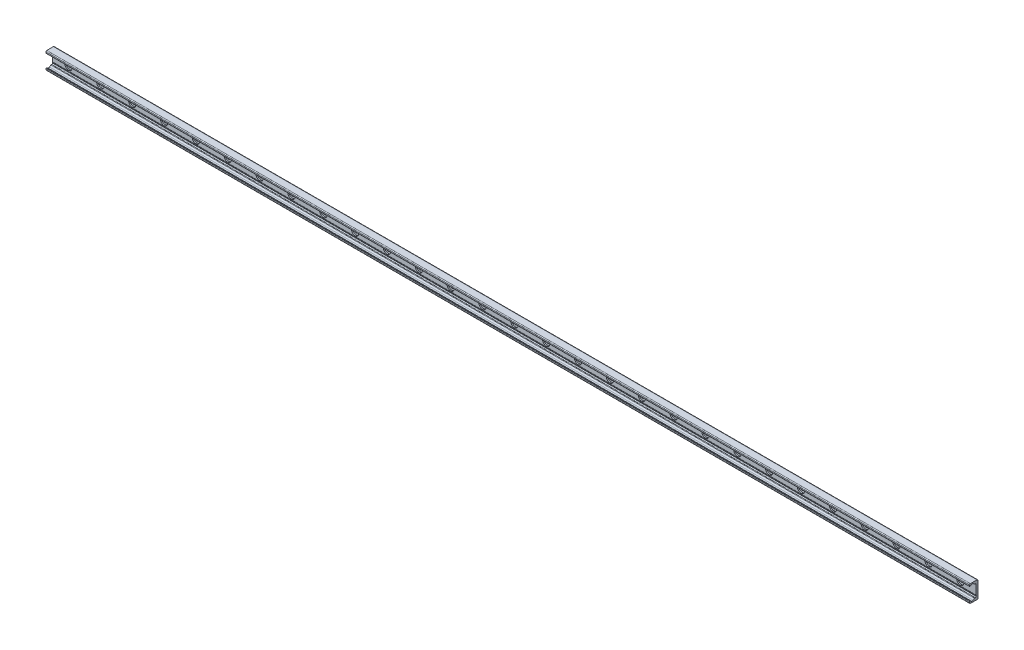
from build123d import *

# Parameters (mm, degrees)
BOSS_EXTRUDE1_DEPTH = 1160
SKETCH2_R           = 9
SKETCH2_R_2         = 4.5
CUT_EXTRUDE1_DEPTH  = 3.1
SKETCH2_2_R         = 4.5
CUT_EXTRUDE2_DEPTH  = 1161.316551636
LPATTERN1_COUNT     = 29
LPATTERN1_PITCH     = 80


with BuildPart() as part:
    # Sketch1 → Boss-Extrude1 (new, symmetric)
    with BuildSketch(Plane(origin=(0, 0, 0), x_dir=(0, 0, -1), z_dir=(1, 0, 0))):
        with BuildLine():
            Line((0, 0), (0, 19))
            ThreePointArc((0, 19), (-0.732233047, 20.767766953), (-2.5, 21.5))
            Line((-2.5, 21.5), (-19, 21.5))
            ThreePointArc((-19, 21.5), (-20.414213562, 20.914213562), (-21, 19.5))
            Line((-21, 19.5), (-21, 16.625057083))
            ThreePointArc((-21, 16.625057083), (-20.553251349, 15.888838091), (-19.693931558, 15.945160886))
            Line((-19.693931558, 15.945160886), (-16.794305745, 17.975500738))
            ThreePointArc((-16.794305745, 17.975500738), (-14.5, 18.69889256), (-12.205694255, 17.975500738))
            Line((-12.205694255, 17.975500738), (-8.829831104, 15.611695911))
            ThreePointArc((-8.829831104, 15.611695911), (-8.28408983, 15.342566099), (-7.682678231, 15.25))
            Line((-7.682678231, 15.25), (-6.5, 15.25))
            ThreePointArc((-6.5, 15.25), (-5.085786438, 14.664213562), (-4.5, 13.25))
            Line((-4.5, 13.25), (-4.5, -10.75))
            ThreePointArc((-4.5, -10.75), (-4.25, -11), (-4.5, -11.25))
            Line((-4.5, -11.25), (-4.5, -12.25))
            ThreePointArc((-4.5, -12.25), (-4.25, -12.5), (-4.5, -12.75))
            Line((-4.5, -12.75), (-4.5, -13.25))
            ThreePointArc((-4.5, -13.25), (-5.085786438, -14.664213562), (-6.5, -15.25))
            Line((-6.5, -15.25), (-7.682678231, -15.25))
            ThreePointArc((-7.682678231, -15.25), (-8.28408983, -15.342566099), (-8.829831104, -15.611695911))
            Line((-8.829831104, -15.611695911), (-12.205694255, -17.975500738))
            ThreePointArc((-12.205694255, -17.975500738), (-14.5, -18.69889256), (-16.794305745, -17.975500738))
            Line((-16.794305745, -17.975500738), (-19.693931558, -15.945160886))
            ThreePointArc((-19.693931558, -15.945160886), (-20.553251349, -15.888838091), (-21, -16.625057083))
            Line((-21, -16.625057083), (-21, -19.5))
            ThreePointArc((-21, -19.5), (-20.414213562, -20.914213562), (-19, -21.5))
            Line((-19, -21.5), (-2.5, -21.5))
            ThreePointArc((-2.5, -21.5), (-0.732233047, -20.767766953), (0, -19))
            Line((0, -19), (0, 0))
        make_face()
    extrude(amount=BOSS_EXTRUDE1_DEPTH, both=True)

    # Sketch2 → Cut-Extrude1 (cut)
    with BuildSketch(Plane.XY.offset(4.5)):
        with Locations((1120, 0)):
            Circle(SKETCH2_R)
        with Locations((1120, 0)):
            Circle(SKETCH2_R_2, mode=Mode.SUBTRACT)
    cut_extrude1 = extrude(amount=-CUT_EXTRUDE1_DEPTH, mode=Mode.SUBTRACT)

    # Sketch2_2 → Cut-Extrude2 (cut, through all)
    with BuildSketch(Plane.XY.offset(4.5)):
        with Locations((1120, 0)):
            Circle(SKETCH2_2_R)
    cut_extrude2 = extrude(amount=-CUT_EXTRUDE2_DEPTH, mode=Mode.SUBTRACT)

    # LPattern1: Cut-Extrude1, Cut-Extrude2 ×29
    with Locations(*[(-i * LPATTERN1_PITCH, 0, 0) for i in range(1, LPATTERN1_COUNT)]):
        add(cut_extrude1, mode=Mode.SUBTRACT)
        add(cut_extrude2, mode=Mode.SUBTRACT)


solid = part.part
